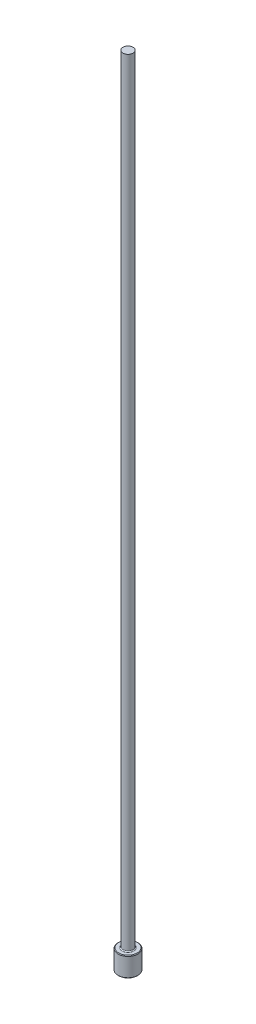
from build123d import *

# Parameters (mm, degrees)
CHAMFER1_SIZE = 0.0508
FILLET1_R     = 0.0762


with BuildPart() as part:
    # Sketch1 → Revolve1 (revolve)
    with BuildSketch(Plane.XY, mode=Mode.PRIVATE) as revolve1_sk:
        Polygon((0, 0), (-0.7874, 0), (-0.7874, 1.5748), (-0.4064, 1.5748), (-0.4064, 63.5), (0, 63.5), align=None)
    revolve(revolve1_sk.sketch.rotate(Axis((0, 259.958771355, 0), (0, -1, 0)), 270), axis=Axis((0, 259.958771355, 0), (0, -1, 0)))

    # Chamfer1
    chamfer1_edges = [part.edges().sort_by_distance(p)[0] for p in [
        (0, 1.5748, -0.7874),
        (0, 0, -0.7874),
    ]]
    chamfer(chamfer1_edges, length=CHAMFER1_SIZE)

    # Fillet1
    fillet1_edges = [part.edges().sort_by_distance(p)[0] for p in [
        (0, 1.5748, -0.4064),
    ]]
    fillet(fillet1_edges, radius=FILLET1_R)


solid = part.part
